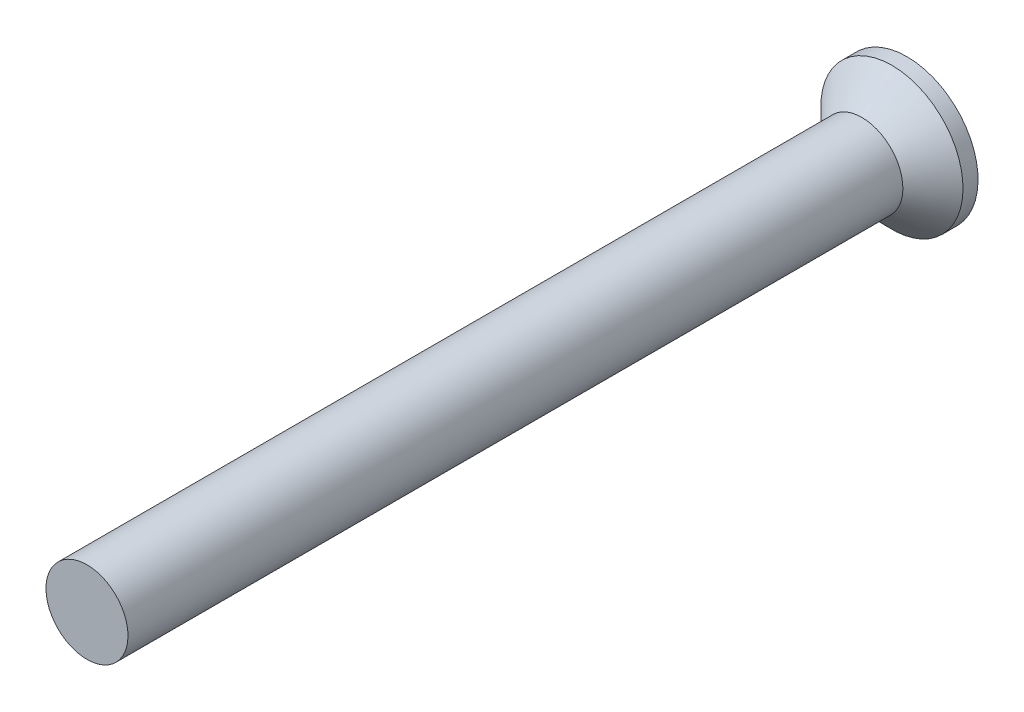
ISO-10303-21;
HEADER;
FILE_DESCRIPTION(('STEP AP214'),'2;1');
FILE_NAME('part.step','',(''),(''),'','','');
FILE_SCHEMA(('AUTOMOTIVE_DESIGN { 1 0 10303 214 1 1 1 1 }'));
ENDSEC;
DATA;
#1=APPLICATION_CONTEXT('core data for automotive mechanical design processes');
#2=APPLICATION_PROTOCOL_DEFINITION('international standard','automotive_design',2000,#1);
#3=PRODUCT_CONTEXT('',#1,'mechanical');
#4=PRODUCT('Part','Part','',(#3));
#5=PRODUCT_RELATED_PRODUCT_CATEGORY('part','',(#4));
#6=PRODUCT_DEFINITION_FORMATION('','',#4);
#7=PRODUCT_DEFINITION_CONTEXT('part definition',#1,'design');
#8=PRODUCT_DEFINITION('design','',#6,#7);
#9=PRODUCT_DEFINITION_SHAPE('','',#8);
#10=(LENGTH_UNIT() NAMED_UNIT(*) SI_UNIT(.MILLI.,.METRE.));
#11=(NAMED_UNIT(*) PLANE_ANGLE_UNIT() SI_UNIT($,.RADIAN.));
#12=(NAMED_UNIT(*) SI_UNIT($,.STERADIAN.) SOLID_ANGLE_UNIT());
#13=UNCERTAINTY_MEASURE_WITH_UNIT(LENGTH_MEASURE(1.E-05),#10,'distance_accuracy_value','');
#14=(GEOMETRIC_REPRESENTATION_CONTEXT(3) GLOBAL_UNCERTAINTY_ASSIGNED_CONTEXT((#13)) GLOBAL_UNIT_ASSIGNED_CONTEXT((#10,
#11,#12)) REPRESENTATION_CONTEXT('',''));
#15=CARTESIAN_POINT('',(0.,0.,0.));
#16=DIRECTION('',(0.,0.,1.));
#17=DIRECTION('',(1.,0.,0.));
#18=AXIS2_PLACEMENT_3D('',#15,#16,#17);
#19=CARTESIAN_POINT('',(-12.4477000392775,-12.8089585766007,-48.95));
#20=DIRECTION('',(0.466823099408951,0.815535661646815,0.34202014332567));
#21=DIRECTION('',(-0.867874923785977,0.496782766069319,0.));
#22=AXIS2_PLACEMENT_3D('',#19,#20,#21);
#23=PLANE('',#22);
#24=DIRECTION('',(0.334819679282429,0.19496847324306,-0.921891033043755));
#25=VECTOR('',#24,1.);
#26=CARTESIAN_POINT('',(-12.8609204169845,-13.0495804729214,-47.8122408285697));
#27=LINE('',#26,#25);
#28=CARTESIAN_POINT('',(-12.8609204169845,-13.0495804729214,-47.8122408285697));
#29=VERTEX_POINT('',#28);
#30=CARTESIAN_POINT('',(-12.7473300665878,-12.9834358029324,-48.125));
#31=VERTEX_POINT('',#30);
#32=EDGE_CURVE('E210',#29,#31,#27,.T.);
#33=ORIENTED_EDGE('',*,*,#32,.T.);
#34=DIRECTION('',(0.867874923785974,-0.496782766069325,0.));
#35=VECTOR('',#34,1.);
#36=CARTESIAN_POINT('',(-12.7473300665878,-12.9834358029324,-48.125));
#37=LINE('',#36,#35);
#38=CARTESIAN_POINT('',(-12.4356627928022,-13.1618381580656,-48.125));
#39=VERTEX_POINT('',#38);
#40=EDGE_CURVE('E429',#31,#39,#37,.T.);
#41=ORIENTED_EDGE('',*,*,#40,.T.);
#42=DIRECTION('',(-0.787968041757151,0.208004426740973,0.579517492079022));
#43=VECTOR('',#42,1.);
#44=CARTESIAN_POINT('',(-12.4356627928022,-13.1618381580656,-48.125));
#45=LINE('',#44,#43);
#46=EDGE_CURVE('E398',#39,#29,#45,.T.);
#47=ORIENTED_EDGE('',*,*,#46,.T.);
#48=EDGE_LOOP('',(#33,#41,#47));
#49=FACE_BOUND('',#48,.T.);
#50=ADVANCED_FACE('F17',(#49),#23,.F.);
#51=CARTESIAN_POINT('',(-12.6202985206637,-13.4628008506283,-48.95));
#52=DIRECTION('',(0.00348716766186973,-0.939686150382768,0.342020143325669));
#53=DIRECTION('',(0.,-0.34202222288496,-0.93969186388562));
#54=AXIS2_PLACEMENT_3D('',#51,#52,#53);
#55=PLANE('',#54);
#56=ORIENTED_EDGE('',*,*,#46,.F.);
#57=DIRECTION('',(-0.9999931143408,-0.0037109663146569,0.));
#58=VECTOR('',#57,1.);
#59=CARTESIAN_POINT('',(-12.4356627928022,-13.1618381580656,-48.125));
#60=LINE('',#59,#58);
#61=CARTESIAN_POINT('',(-12.7947757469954,-13.1631708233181,-48.125));
#62=VERTEX_POINT('',#61);
#63=EDGE_CURVE('E499',#39,#62,#60,.T.);
#64=ORIENTED_EDGE('',*,*,#63,.T.);
#65=DIRECTION('',(-0.19496847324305,0.33481967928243,0.921891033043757));
#66=VECTOR('',#65,1.);
#67=CARTESIAN_POINT('',(-12.7947757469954,-13.1631708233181,-48.125));
#68=LINE('',#67,#66);
#69=EDGE_CURVE('E395',#62,#29,#68,.T.);
#70=ORIENTED_EDGE('',*,*,#69,.T.);
#71=EDGE_LOOP('',(#56,#64,#70));
#72=FACE_BOUND('',#71,.T.);
#73=ADVANCED_FACE('F719',(#72),#55,.F.);
#74=CARTESIAN_POINT('',(-12.6202985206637,-13.4628008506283,-48.95));
#75=DIRECTION('',(0.815535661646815,-0.466823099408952,0.34202014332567));
#76=DIRECTION('',(0.49678276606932,0.867874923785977,0.));
#77=AXIS2_PLACEMENT_3D('',#74,#75,#76);
#78=PLANE('',#77);
#79=ORIENTED_EDGE('',*,*,#69,.F.);
#80=DIRECTION('',(-0.496782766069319,-0.867874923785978,0.));
#81=VECTOR('',#80,1.);
#82=CARTESIAN_POINT('',(-12.7947757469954,-13.1631708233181,-48.125));
#83=LINE('',#82,#81);
#84=CARTESIAN_POINT('',(-12.9731781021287,-13.4748380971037,-48.125));
#85=VERTEX_POINT('',#84);
#86=EDGE_CURVE('E497',#62,#85,#83,.T.);
#87=ORIENTED_EDGE('',*,*,#86,.T.);
#88=DIRECTION('',(0.208004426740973,0.787968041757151,0.579517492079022));
#89=VECTOR('',#88,1.);
#90=CARTESIAN_POINT('',(-12.9731781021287,-13.4748380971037,-48.125));
#91=LINE('',#90,#89);
#92=EDGE_CURVE('E392',#85,#29,#91,.T.);
#93=ORIENTED_EDGE('',*,*,#92,.T.);
#94=EDGE_LOOP('',(#79,#87,#93));
#95=FACE_BOUND('',#94,.T.);
#96=ADVANCED_FACE('F723',(#95),#78,.F.);
#97=CARTESIAN_POINT('',(-13.2741407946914,-13.2902023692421,-48.95));
#98=DIRECTION('',(-0.939686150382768,-0.00348716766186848,0.342020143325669));
#99=DIRECTION('',(0.34202222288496,0.,0.93969186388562));
#100=AXIS2_PLACEMENT_3D('',#97,#98,#99);
#101=PLANE('',#100);
#102=ORIENTED_EDGE('',*,*,#92,.F.);
#103=DIRECTION('',(-0.00371096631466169,0.9999931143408,0.));
#104=VECTOR('',#103,1.);
#105=CARTESIAN_POINT('',(-12.9731781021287,-13.4748380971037,-48.125));
#106=LINE('',#105,#104);
#107=CARTESIAN_POINT('',(-12.9745107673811,-13.1157251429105,-48.125));
#108=VERTEX_POINT('',#107);
#109=EDGE_CURVE('E495',#85,#108,#106,.T.);
#110=ORIENTED_EDGE('',*,*,#109,.T.);
#111=DIRECTION('',(0.334819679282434,0.19496847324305,0.921891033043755));
#112=VECTOR('',#111,1.);
#113=CARTESIAN_POINT('',(-12.9745107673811,-13.1157251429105,-48.125));
#114=LINE('',#113,#112);
#115=EDGE_CURVE('E389',#108,#29,#114,.T.);
#116=ORIENTED_EDGE('',*,*,#115,.T.);
#117=EDGE_LOOP('',(#102,#110,#116));
#118=FACE_BOUND('',#117,.T.);
#119=ADVANCED_FACE('F727',(#118),#101,.F.);
#120=CARTESIAN_POINT('',(-13.2741407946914,-13.2902023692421,-48.95));
#121=DIRECTION('',(-0.46682309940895,-0.815535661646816,0.342020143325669));
#122=DIRECTION('',(0.867874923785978,-0.496782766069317,0.));
#123=AXIS2_PLACEMENT_3D('',#120,#121,#122);
#124=PLANE('',#123);
#125=ORIENTED_EDGE('',*,*,#115,.F.);
#126=DIRECTION('',(-0.867874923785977,0.496782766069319,0.));
#127=VECTOR('',#126,1.);
#128=CARTESIAN_POINT('',(-12.9745107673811,-13.1157251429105,-48.125));
#129=LINE('',#128,#127);
#130=CARTESIAN_POINT('',(-13.2861780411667,-12.9373227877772,-48.125));
#131=VERTEX_POINT('',#130);
#132=EDGE_CURVE('E493',#108,#131,#129,.T.);
#133=ORIENTED_EDGE('',*,*,#132,.T.);
#134=DIRECTION('',(0.787968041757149,-0.208004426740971,0.579517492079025));
#135=VECTOR('',#134,1.);
#136=CARTESIAN_POINT('',(-13.2861780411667,-12.9373227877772,-48.125));
#137=LINE('',#136,#135);
#138=EDGE_CURVE('E386',#131,#29,#137,.T.);
#139=ORIENTED_EDGE('',*,*,#138,.T.);
#140=EDGE_LOOP('',(#125,#133,#139));
#141=FACE_BOUND('',#140,.T.);
#142=ADVANCED_FACE('F730',(#141),#124,.F.);
#143=CARTESIAN_POINT('',(-13.1015423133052,-12.6363600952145,-48.95));
#144=DIRECTION('',(-0.00348716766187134,0.939686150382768,0.34202014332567));
#145=DIRECTION('',(0.,-0.34202222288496,0.93969186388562));
#146=AXIS2_PLACEMENT_3D('',#143,#144,#145);
#147=PLANE('',#146);
#148=ORIENTED_EDGE('',*,*,#138,.F.);
#149=DIRECTION('',(0.9999931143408,0.00371096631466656,0.));
#150=VECTOR('',#149,1.);
#151=CARTESIAN_POINT('',(-13.2861780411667,-12.9373227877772,-48.125));
#152=LINE('',#151,#150);
#153=CARTESIAN_POINT('',(-12.9270650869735,-12.9359901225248,-48.125));
#154=VERTEX_POINT('',#153);
#155=EDGE_CURVE('E491',#131,#154,#152,.T.);
#156=ORIENTED_EDGE('',*,*,#155,.T.);
#157=DIRECTION('',(0.19496847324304,-0.334819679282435,0.921891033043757));
#158=VECTOR('',#157,1.);
#159=CARTESIAN_POINT('',(-12.9270650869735,-12.9359901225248,-48.125));
#160=LINE('',#159,#158);
#161=EDGE_CURVE('E383',#154,#29,#160,.T.);
#162=ORIENTED_EDGE('',*,*,#161,.T.);
#163=EDGE_LOOP('',(#148,#156,#162));
#164=FACE_BOUND('',#163,.T.);
#165=ADVANCED_FACE('F732',(#164),#147,.F.);
#166=CARTESIAN_POINT('',(-13.1015423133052,-12.6363600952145,-48.95));
#167=DIRECTION('',(-0.815535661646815,0.466823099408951,0.342020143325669));
#168=DIRECTION('',(-0.496782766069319,-0.867874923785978,0.));
#169=AXIS2_PLACEMENT_3D('',#166,#167,#168);
#170=PLANE('',#169);
#171=ORIENTED_EDGE('',*,*,#161,.F.);
#172=DIRECTION('',(0.496782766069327,0.867874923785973,0.));
#173=VECTOR('',#172,1.);
#174=CARTESIAN_POINT('',(-12.9270650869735,-12.9359901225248,-48.125));
#175=LINE('',#174,#173);
#176=CARTESIAN_POINT('',(-12.7486627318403,-12.6243228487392,-48.125));
#177=VERTEX_POINT('',#176);
#178=EDGE_CURVE('E489',#154,#177,#175,.T.);
#179=ORIENTED_EDGE('',*,*,#178,.T.);
#180=DIRECTION('',(-0.208004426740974,-0.787968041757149,0.579517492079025));
#181=VECTOR('',#180,1.);
#182=CARTESIAN_POINT('',(-12.7486627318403,-12.6243228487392,-48.125));
#183=LINE('',#182,#181);
#184=EDGE_CURVE('E380',#177,#29,#183,.T.);
#185=ORIENTED_EDGE('',*,*,#184,.T.);
#186=EDGE_LOOP('',(#171,#179,#185));
#187=FACE_BOUND('',#186,.T.);
#188=ADVANCED_FACE('F711',(#187),#170,.F.);
#189=CARTESIAN_POINT('',(-12.4477000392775,-12.8089585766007,-48.95));
#190=DIRECTION('',(0.939686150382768,0.00348716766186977,0.342020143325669));
#191=DIRECTION('',(0.34202222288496,0.,-0.93969186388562));
#192=AXIS2_PLACEMENT_3D('',#189,#190,#191);
#193=PLANE('',#192);
#194=ORIENTED_EDGE('',*,*,#184,.F.);
#195=DIRECTION('',(0.00371096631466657,-0.9999931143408,0.));
#196=VECTOR('',#195,1.);
#197=CARTESIAN_POINT('',(-12.7486627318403,-12.6243228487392,-48.125));
#198=LINE('',#197,#196);
#199=EDGE_CURVE('E427',#177,#31,#198,.T.);
#200=ORIENTED_EDGE('',*,*,#199,.T.);
#201=ORIENTED_EDGE('',*,*,#32,.F.);
#202=EDGE_LOOP('',(#194,#200,#201));
#203=FACE_BOUND('',#202,.T.);
#204=ADVANCED_FACE('F623',(#203),#193,.F.);
#205=CARTESIAN_POINT('',(-12.6371291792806,-12.2018084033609,-48.125));
#206=DIRECTION('',(0.,0.,1.));
#207=DIRECTION('',(0.,-1.,0.));
#208=AXIS2_PLACEMENT_3D('',#205,#206,#207);
#209=CYLINDRICAL_SURFACE('',#208,0.3);
#210=CARTESIAN_POINT('',(-12.6371291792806,-12.2018084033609,-48.4357416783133));
#211=DIRECTION('',(0.939686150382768,0.00348716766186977,0.342020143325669));
#212=DIRECTION('',(-0.342017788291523,-0.0012692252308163,0.939692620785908));
#213=AXIS2_PLACEMENT_3D('',#210,#211,#212);
#214=ELLIPSE('',#213,0.877141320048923,0.3);
#215=CARTESIAN_POINT('',(-12.7136990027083,-12.4918722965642,-48.2224118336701));
#216=VERTEX_POINT('',#215);
#217=CARTESIAN_POINT('',(-12.4861660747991,-12.4610575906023,-48.8478632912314));
#218=VERTEX_POINT('',#217);
#219=EDGE_CURVE('E342',#216,#218,#214,.T.);
#220=ORIENTED_EDGE('',*,*,#219,.T.);
#221=DIRECTION('',(0.,0.,1.));
#222=VECTOR('',#221,1.);
#223=CARTESIAN_POINT('',(-12.4861660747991,-12.4610575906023,-48.125));
#224=LINE('',#223,#222);
#225=CARTESIAN_POINT('',(-12.4861660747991,-12.4610575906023,-48.125));
#226=VERTEX_POINT('',#225);
#227=EDGE_CURVE('E339',#226,#218,#224,.F.);
#228=ORIENTED_EDGE('',*,*,#227,.F.);
#229=CARTESIAN_POINT('',(-12.6371291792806,-12.2018084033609,-48.125));
#230=DIRECTION('',(0.,0.,1.));
#231=DIRECTION('',(0.,-1.,0.));
#232=AXIS2_PLACEMENT_3D('',#229,#230,#231);
#233=CIRCLE('',#232,0.3);
#234=CARTESIAN_POINT('',(-12.896378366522,-12.3527715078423,-48.125));
#235=VERTEX_POINT('',#234);
#236=EDGE_CURVE('E209',#226,#235,#233,.F.);
#237=ORIENTED_EDGE('',*,*,#236,.T.);
#238=DIRECTION('',(0.,0.,1.));
#239=VECTOR('',#238,1.);
#240=CARTESIAN_POINT('',(-12.896378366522,-12.3527715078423,-48.125));
#241=LINE('',#240,#239);
#242=CARTESIAN_POINT('',(-12.896378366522,-12.3527715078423,-48.8478632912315));
#243=VERTEX_POINT('',#242);
#244=EDGE_CURVE('E299',#243,#235,#241,.T.);
#245=ORIENTED_EDGE('',*,*,#244,.F.);
#246=CARTESIAN_POINT('',(-12.6371291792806,-12.2018084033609,-48.4357416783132));
#247=DIRECTION('',(-0.815535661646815,0.466823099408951,0.342020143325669));
#248=DIRECTION('',(0.296830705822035,-0.169909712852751,0.939692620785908));
#249=AXIS2_PLACEMENT_3D('',#246,#247,#248);
#250=ELLIPSE('',#249,0.877141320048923,0.3);
#251=EDGE_CURVE('E421',#243,#216,#250,.T.);
#252=ORIENTED_EDGE('',*,*,#251,.T.);
#253=EDGE_LOOP('',(#220,#228,#237,#245,#252));
#254=FACE_BOUND('',#253,.T.);
#255=ADVANCED_FACE('F434',(#254),#209,.T.);
#256=CARTESIAN_POINT('',(-13.708692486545,-12.8257892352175,-48.125));
#257=DIRECTION('',(0.,0.,1.));
#258=DIRECTION('',(0.,-1.,0.));
#259=AXIS2_PLACEMENT_3D('',#256,#257,#258);
#260=CYLINDRICAL_SURFACE('',#259,0.3);
#261=CARTESIAN_POINT('',(-13.708692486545,-12.8257892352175,-48.4357416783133));
#262=DIRECTION('',(-0.00348716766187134,0.939686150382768,0.34202014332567));
#263=DIRECTION('',(0.00126922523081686,-0.342017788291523,0.939692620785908));
#264=AXIS2_PLACEMENT_3D('',#261,#262,#263);
#265=ELLIPSE('',#264,0.877141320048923,0.3);
#266=CARTESIAN_POINT('',(-13.4186285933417,-12.9023590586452,-48.2224118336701));
#267=VERTEX_POINT('',#266);
#268=CARTESIAN_POINT('',(-13.4494432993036,-12.6748261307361,-48.8478632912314));
#269=VERTEX_POINT('',#268);
#270=EDGE_CURVE('E280',#267,#269,#265,.T.);
#271=ORIENTED_EDGE('',*,*,#270,.T.);
#272=DIRECTION('',(0.,0.,1.));
#273=VECTOR('',#272,1.);
#274=CARTESIAN_POINT('',(-13.4494432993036,-12.6748261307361,-48.125));
#275=LINE('',#274,#273);
#276=CARTESIAN_POINT('',(-13.4494432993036,-12.6748261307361,-48.125));
#277=VERTEX_POINT('',#276);
#278=EDGE_CURVE('E277',#277,#269,#275,.F.);
#279=ORIENTED_EDGE('',*,*,#278,.F.);
#280=CARTESIAN_POINT('',(-13.708692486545,-12.8257892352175,-48.125));
#281=DIRECTION('',(0.,0.,1.));
#282=DIRECTION('',(0.,-1.,0.));
#283=AXIS2_PLACEMENT_3D('',#280,#281,#282);
#284=CIRCLE('',#283,0.3);
#285=CARTESIAN_POINT('',(-13.5577293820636,-13.0850384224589,-48.125));
#286=VERTEX_POINT('',#285);
#287=EDGE_CURVE('E428',#277,#286,#284,.F.);
#288=ORIENTED_EDGE('',*,*,#287,.T.);
#289=DIRECTION('',(0.,0.,1.));
#290=VECTOR('',#289,1.);
#291=CARTESIAN_POINT('',(-13.5577293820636,-13.0850384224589,-48.125));
#292=LINE('',#291,#290);
#293=CARTESIAN_POINT('',(-13.5577293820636,-13.0850384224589,-48.8478632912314));
#294=VERTEX_POINT('',#293);
#295=EDGE_CURVE('E235',#294,#286,#292,.T.);
#296=ORIENTED_EDGE('',*,*,#295,.F.);
#297=CARTESIAN_POINT('',(-13.708692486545,-12.8257892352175,-48.4357416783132));
#298=DIRECTION('',(-0.46682309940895,-0.815535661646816,0.342020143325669));
#299=DIRECTION('',(0.16990971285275,0.296830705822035,0.939692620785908));
#300=AXIS2_PLACEMENT_3D('',#297,#298,#299);
#301=ELLIPSE('',#300,0.877141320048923,0.3);
#302=EDGE_CURVE('E417',#294,#267,#301,.T.);
#303=ORIENTED_EDGE('',*,*,#302,.T.);
#304=EDGE_LOOP('',(#271,#279,#288,#296,#303));
#305=FACE_BOUND('',#304,.T.);
#306=ADVANCED_FACE('F614',(#305),#260,.T.);
#307=CARTESIAN_POINT('',(-13.0847116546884,-13.897352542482,-48.125));
#308=DIRECTION('',(0.,0.,1.));
#309=DIRECTION('',(0.,-1.,0.));
#310=AXIS2_PLACEMENT_3D('',#307,#308,#309);
#311=CYLINDRICAL_SURFACE('',#310,0.3);
#312=CARTESIAN_POINT('',(-13.0847116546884,-13.897352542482,-48.4357416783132));
#313=DIRECTION('',(-0.939686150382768,-0.00348716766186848,0.342020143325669));
#314=DIRECTION('',(0.342017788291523,0.00126922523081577,0.939692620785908));
#315=AXIS2_PLACEMENT_3D('',#312,#313,#314);
#316=ELLIPSE('',#315,0.877141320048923,0.3);
#317=CARTESIAN_POINT('',(-13.0081418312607,-13.6072886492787,-48.2224118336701));
#318=VERTEX_POINT('',#317);
#319=CARTESIAN_POINT('',(-13.2356747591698,-13.6381033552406,-48.8478632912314));
#320=VERTEX_POINT('',#319);
#321=EDGE_CURVE('E215',#318,#320,#316,.T.);
#322=ORIENTED_EDGE('',*,*,#321,.T.);
#323=DIRECTION('',(0.,0.,1.));
#324=VECTOR('',#323,1.);
#325=CARTESIAN_POINT('',(-13.2356747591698,-13.6381033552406,-48.125));
#326=LINE('',#325,#324);
#327=CARTESIAN_POINT('',(-13.2356747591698,-13.6381033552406,-48.125));
#328=VERTEX_POINT('',#327);
#329=EDGE_CURVE('E212',#328,#320,#326,.F.);
#330=ORIENTED_EDGE('',*,*,#329,.F.);
#331=CARTESIAN_POINT('',(-13.0847116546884,-13.897352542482,-48.125));
#332=DIRECTION('',(0.,0.,1.));
#333=DIRECTION('',(0.,-1.,0.));
#334=AXIS2_PLACEMENT_3D('',#331,#332,#333);
#335=CIRCLE('',#334,0.3);
#336=CARTESIAN_POINT('',(-12.825462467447,-13.7463894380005,-48.125));
#337=VERTEX_POINT('',#336);
#338=EDGE_CURVE('E20',#328,#337,#335,.F.);
#339=ORIENTED_EDGE('',*,*,#338,.T.);
#340=DIRECTION('',(0.,0.,1.));
#341=VECTOR('',#340,1.);
#342=CARTESIAN_POINT('',(-12.825462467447,-13.7463894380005,-48.125));
#343=LINE('',#342,#341);
#344=CARTESIAN_POINT('',(-12.825462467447,-13.7463894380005,-48.8478632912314));
#345=VERTEX_POINT('',#344);
#346=EDGE_CURVE('E509',#345,#337,#343,.T.);
#347=ORIENTED_EDGE('',*,*,#346,.F.);
#348=CARTESIAN_POINT('',(-13.0847116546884,-13.897352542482,-48.4357416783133));
#349=DIRECTION('',(0.815535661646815,-0.466823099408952,0.34202014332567));
#350=DIRECTION('',(-0.296830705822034,0.169909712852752,0.939692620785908));
#351=AXIS2_PLACEMENT_3D('',#348,#349,#350);
#352=ELLIPSE('',#351,0.877141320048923,0.3);
#353=EDGE_CURVE('E412',#345,#318,#352,.T.);
#354=ORIENTED_EDGE('',*,*,#353,.T.);
#355=EDGE_LOOP('',(#322,#330,#339,#347,#354));
#356=FACE_BOUND('',#355,.T.);
#357=ADVANCED_FACE('F213',(#356),#311,.T.);
#358=CARTESIAN_POINT('',(-13.2984801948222,-12.9340753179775,-48.125));
#359=DIRECTION('',(0.,0.,1.));
#360=DIRECTION('',(0.,-1.,0.));
#361=AXIS2_PLACEMENT_3D('',#358,#359,#360);
#362=PLANE('',#361);
#363=ORIENTED_EDGE('',*,*,#178,.F.);
#364=ORIENTED_EDGE('',*,*,#155,.F.);
#365=ORIENTED_EDGE('',*,*,#132,.F.);
#366=ORIENTED_EDGE('',*,*,#109,.F.);
#367=ORIENTED_EDGE('',*,*,#86,.F.);
#368=ORIENTED_EDGE('',*,*,#63,.F.);
#369=ORIENTED_EDGE('',*,*,#40,.F.);
#370=ORIENTED_EDGE('',*,*,#199,.F.);
#371=EDGE_LOOP('',(#363,#364,#365,#366,#367,#368,#369,#370));
#372=FACE_BOUND('',#371,.T.);
#373=DIRECTION('',(-0.503210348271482,0.86416395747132,0.));
#374=VECTOR('',#373,1.);
#375=CARTESIAN_POINT('',(-13.2984801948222,-12.9340753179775,-48.125));
#376=LINE('',#375,#374);
#377=CARTESIAN_POINT('',(-13.702903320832,-12.239558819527,-48.125));
#378=VERTEX_POINT('',#377);
#379=EDGE_CURVE('E281',#378,#277,#376,.F.);
#380=ORIENTED_EDGE('',*,*,#379,.F.);
#381=DIRECTION('',(-0.86416395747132,-0.503210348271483,0.));
#382=VECTOR('',#381,1.);
#383=CARTESIAN_POINT('',(-13.1498383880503,-11.9175041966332,-48.125));
#384=LINE('',#383,#382);
#385=CARTESIAN_POINT('',(-13.1498383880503,-11.9175041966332,-48.125));
#386=VERTEX_POINT('',#385);
#387=EDGE_CURVE('E297',#386,#378,#384,.T.);
#388=ORIENTED_EDGE('',*,*,#387,.F.);
#389=DIRECTION('',(0.503210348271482,-0.86416395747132,0.));
#390=VECTOR('',#389,1.);
#391=CARTESIAN_POINT('',(-12.7454152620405,-12.6120206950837,-48.125));
#392=LINE('',#391,#390);
#393=EDGE_CURVE('E307',#235,#386,#392,.F.);
#394=ORIENTED_EDGE('',*,*,#393,.F.);
#395=ORIENTED_EDGE('',*,*,#236,.F.);
#396=DIRECTION('',(0.86416395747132,0.503210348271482,0.));
#397=VECTOR('',#396,1.);
#398=CARTESIAN_POINT('',(-12.7454152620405,-12.6120206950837,-48.125));
#399=LINE('',#398,#397);
#400=CARTESIAN_POINT('',(-12.05089876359,-12.2075975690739,-48.125));
#401=VERTEX_POINT('',#400);
#402=EDGE_CURVE('E343',#401,#226,#399,.F.);
#403=ORIENTED_EDGE('',*,*,#402,.F.);
#404=DIRECTION('',(-0.503210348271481,0.864163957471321,0.));
#405=VECTOR('',#404,1.);
#406=CARTESIAN_POINT('',(-11.7288441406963,-12.7606625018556,-48.125));
#407=LINE('',#406,#405);
#408=CARTESIAN_POINT('',(-11.7288441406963,-12.7606625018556,-48.125));
#409=VERTEX_POINT('',#408);
#410=EDGE_CURVE('E359',#409,#401,#407,.T.);
#411=ORIENTED_EDGE('',*,*,#410,.F.);
#412=DIRECTION('',(-0.86416395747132,-0.503210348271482,0.));
#413=VECTOR('',#412,1.);
#414=CARTESIAN_POINT('',(-12.4233606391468,-13.1650856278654,-48.125));
#415=LINE('',#414,#413);
#416=CARTESIAN_POINT('',(-12.1641114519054,-13.0141225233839,-48.125));
#417=VERTEX_POINT('',#416);
#418=EDGE_CURVE('E369',#417,#409,#415,.F.);
#419=ORIENTED_EDGE('',*,*,#418,.F.);
#420=CARTESIAN_POINT('',(-12.0131483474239,-13.2733717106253,-48.125));
#421=DIRECTION('',(0.,0.,1.));
#422=DIRECTION('',(0.,-1.,0.));
#423=AXIS2_PLACEMENT_3D('',#420,#421,#422);
#424=CIRCLE('',#423,0.3);
#425=CARTESIAN_POINT('',(-12.2723975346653,-13.4243348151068,-48.125));
#426=VERTEX_POINT('',#425);
#427=EDGE_CURVE('E372',#426,#417,#424,.F.);
#428=ORIENTED_EDGE('',*,*,#427,.F.);
#429=DIRECTION('',(0.503210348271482,-0.86416395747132,0.));
#430=VECTOR('',#429,1.);
#431=CARTESIAN_POINT('',(-12.4233606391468,-13.1650856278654,-48.125));
#432=LINE('',#431,#430);
#433=CARTESIAN_POINT('',(-12.0189375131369,-13.8596021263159,-48.125));
#434=VERTEX_POINT('',#433);
#435=EDGE_CURVE('E476',#434,#426,#432,.F.);
#436=ORIENTED_EDGE('',*,*,#435,.F.);
#437=DIRECTION('',(0.86416395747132,0.503210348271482,0.));
#438=VECTOR('',#437,1.);
#439=CARTESIAN_POINT('',(-12.5720024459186,-14.1816567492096,-48.125));
#440=LINE('',#439,#438);
#441=CARTESIAN_POINT('',(-12.5720024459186,-14.1816567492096,-48.125));
#442=VERTEX_POINT('',#441);
#443=EDGE_CURVE('E507',#442,#434,#440,.T.);
#444=ORIENTED_EDGE('',*,*,#443,.F.);
#445=DIRECTION('',(-0.503210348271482,0.86416395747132,0.));
#446=VECTOR('',#445,1.);
#447=CARTESIAN_POINT('',(-12.9764255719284,-13.4871402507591,-48.125));
#448=LINE('',#447,#446);
#449=EDGE_CURVE('E205',#337,#442,#448,.F.);
#450=ORIENTED_EDGE('',*,*,#449,.F.);
#451=ORIENTED_EDGE('',*,*,#338,.F.);
#452=DIRECTION('',(-0.86416395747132,-0.503210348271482,0.));
#453=VECTOR('',#452,1.);
#454=CARTESIAN_POINT('',(-12.9764255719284,-13.4871402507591,-48.125));
#455=LINE('',#454,#453);
#456=CARTESIAN_POINT('',(-13.6709420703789,-13.8915633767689,-48.125));
#457=VERTEX_POINT('',#456);
#458=EDGE_CURVE('E202',#457,#328,#455,.F.);
#459=ORIENTED_EDGE('',*,*,#458,.F.);
#460=DIRECTION('',(0.503210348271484,-0.864163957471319,0.));
#461=VECTOR('',#460,1.);
#462=CARTESIAN_POINT('',(-13.9929966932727,-13.3384984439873,-48.125));
#463=LINE('',#462,#461);
#464=CARTESIAN_POINT('',(-13.9929966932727,-13.3384984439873,-48.125));
#465=VERTEX_POINT('',#464);
#466=EDGE_CURVE('E233',#465,#457,#463,.T.);
#467=ORIENTED_EDGE('',*,*,#466,.F.);
#468=DIRECTION('',(0.86416395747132,0.503210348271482,0.));
#469=VECTOR('',#468,1.);
#470=CARTESIAN_POINT('',(-13.2984801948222,-12.9340753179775,-48.125));
#471=LINE('',#470,#469);
#472=EDGE_CURVE('E245',#286,#465,#471,.F.);
#473=ORIENTED_EDGE('',*,*,#472,.F.);
#474=ORIENTED_EDGE('',*,*,#287,.F.);
#475=EDGE_LOOP('',(#380,#388,#394,#395,#403,#411,#419,#428,#436,#444,#450,#451,#459,#467,#473,#474));
#476=FACE_BOUND('',#475,.T.);
#477=ADVANCED_FACE('F200',(#372,#476),#362,.F.);
#478=CARTESIAN_POINT('',(-12.0131483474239,-13.2733717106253,-48.125));
#479=DIRECTION('',(0.,0.,1.));
#480=DIRECTION('',(0.,-1.,0.));
#481=AXIS2_PLACEMENT_3D('',#478,#479,#480);
#482=CYLINDRICAL_SURFACE('',#481,0.3);
#483=CARTESIAN_POINT('',(-12.0131483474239,-13.2733717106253,-48.4357416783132));
#484=DIRECTION('',(0.466823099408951,0.815535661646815,0.34202014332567));
#485=DIRECTION('',(-0.169909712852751,-0.296830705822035,0.939692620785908));
#486=AXIS2_PLACEMENT_3D('',#483,#484,#485);
#487=ELLIPSE('',#486,0.877141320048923,0.3);
#488=CARTESIAN_POINT('',(-12.1641114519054,-13.0141225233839,-48.8478632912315));
#489=VERTEX_POINT('',#488);
#490=CARTESIAN_POINT('',(-12.3032122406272,-13.1968018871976,-48.2224118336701));
#491=VERTEX_POINT('',#490);
#492=EDGE_CURVE('E405',#489,#491,#487,.T.);
#493=ORIENTED_EDGE('',*,*,#492,.T.);
#494=CARTESIAN_POINT('',(-12.0131483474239,-13.2733717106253,-48.4357416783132));
#495=DIRECTION('',(0.00348716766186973,-0.939686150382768,0.342020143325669));
#496=DIRECTION('',(-0.00126922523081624,0.342017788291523,0.939692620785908));
#497=AXIS2_PLACEMENT_3D('',#494,#495,#496);
#498=ELLIPSE('',#497,0.877141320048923,0.3);
#499=CARTESIAN_POINT('',(-12.2723975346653,-13.4243348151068,-48.8478632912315));
#500=VERTEX_POINT('',#499);
#501=EDGE_CURVE('E408',#491,#500,#498,.T.);
#502=ORIENTED_EDGE('',*,*,#501,.T.);
#503=DIRECTION('',(0.,0.,1.));
#504=VECTOR('',#503,1.);
#505=CARTESIAN_POINT('',(-12.2723975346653,-13.4243348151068,-48.125));
#506=LINE('',#505,#504);
#507=EDGE_CURVE('E411',#426,#500,#506,.F.);
#508=ORIENTED_EDGE('',*,*,#507,.F.);
#509=ORIENTED_EDGE('',*,*,#427,.T.);
#510=DIRECTION('',(0.,0.,1.));
#511=VECTOR('',#510,1.);
#512=CARTESIAN_POINT('',(-12.1641114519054,-13.0141225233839,-48.125));
#513=LINE('',#512,#511);
#514=EDGE_CURVE('E361',#489,#417,#513,.T.);
#515=ORIENTED_EDGE('',*,*,#514,.F.);
#516=EDGE_LOOP('',(#493,#502,#508,#509,#515));
#517=FACE_BOUND('',#516,.T.);
#518=ADVANCED_FACE('F694',(#517),#482,.T.);
#519=CARTESIAN_POINT('',(-12.4233606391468,-13.1650856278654,-48.125));
#520=DIRECTION('',(-0.503210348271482,0.86416395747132,0.));
#521=DIRECTION('',(-0.86416395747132,-0.503210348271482,0.));
#522=AXIS2_PLACEMENT_3D('',#519,#520,#521);
#523=PLANE('',#522);
#524=DIRECTION('',(-0.334819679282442,-0.194968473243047,0.921891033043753));
#525=VECTOR('',#524,1.);
#526=CARTESIAN_POINT('',(-12.1270166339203,-12.9925218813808,-48.95));
#527=LINE('',#526,#525);
#528=CARTESIAN_POINT('',(-12.1270166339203,-12.9925218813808,-48.95));
#529=VERTEX_POINT('',#528);
#530=EDGE_CURVE('E407',#529,#489,#527,.T.);
#531=ORIENTED_EDGE('',*,*,#530,.T.);
#532=ORIENTED_EDGE('',*,*,#514,.T.);
#533=ORIENTED_EDGE('',*,*,#418,.T.);
#534=DIRECTION('',(-0.432081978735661,-0.251605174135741,0.866025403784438));
#535=VECTOR('',#534,1.);
#536=CARTESIAN_POINT('',(-11.3172307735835,-12.5209763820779,-48.95));
#537=LINE('',#536,#535);
#538=CARTESIAN_POINT('',(-11.3172307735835,-12.5209763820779,-48.95));
#539=VERTEX_POINT('',#538);
#540=EDGE_CURVE('E356',#539,#409,#537,.T.);
#541=ORIENTED_EDGE('',*,*,#540,.F.);
#542=DIRECTION('',(0.86416395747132,0.503210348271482,0.));
#543=VECTOR('',#542,1.);
#544=CARTESIAN_POINT('',(-12.1270166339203,-12.9925218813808,-48.95));
#545=LINE('',#544,#543);
#546=EDGE_CURVE('E366',#529,#539,#545,.T.);
#547=ORIENTED_EDGE('',*,*,#546,.F.);
#548=EDGE_LOOP('',(#531,#532,#533,#541,#547));
#549=FACE_BOUND('',#548,.T.);
#550=ADVANCED_FACE('F690',(#549),#523,.T.);
#551=CARTESIAN_POINT('',(-11.6392853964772,-11.9679114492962,-48.95));
#552=DIRECTION('',(-0.748387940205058,-0.435792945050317,-0.500000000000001));
#553=DIRECTION('',(-0.555526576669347,0.,0.831498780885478));
#554=AXIS2_PLACEMENT_3D('',#551,#552,#553);
#555=PLANE('',#554);
#556=DIRECTION('',(-0.503210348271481,0.864163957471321,0.));
#557=VECTOR('',#556,1.);
#558=CARTESIAN_POINT('',(-11.3172307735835,-12.5209763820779,-48.95));
#559=LINE('',#558,#557);
#560=CARTESIAN_POINT('',(-11.6392853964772,-11.9679114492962,-48.95));
#561=VERTEX_POINT('',#560);
#562=EDGE_CURVE('E346',#539,#561,#559,.T.);
#563=ORIENTED_EDGE('',*,*,#562,.F.);
#564=ORIENTED_EDGE('',*,*,#540,.T.);
#565=ORIENTED_EDGE('',*,*,#410,.T.);
#566=DIRECTION('',(-0.432081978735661,-0.251605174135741,0.866025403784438));
#567=VECTOR('',#566,1.);
#568=CARTESIAN_POINT('',(-11.6392853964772,-11.9679114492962,-48.95));
#569=LINE('',#568,#567);
#570=EDGE_CURVE('E351',#561,#401,#569,.T.);
#571=ORIENTED_EDGE('',*,*,#570,.F.);
#572=EDGE_LOOP('',(#563,#564,#565,#571));
#573=FACE_BOUND('',#572,.T.);
#574=ADVANCED_FACE('F687',(#573),#555,.T.);
#575=CARTESIAN_POINT('',(-12.7454152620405,-12.6120206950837,-48.125));
#576=DIRECTION('',(0.503210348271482,-0.86416395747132,0.));
#577=DIRECTION('',(0.86416395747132,0.503210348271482,0.));
#578=AXIS2_PLACEMENT_3D('',#575,#576,#577);
#579=PLANE('',#578);
#580=DIRECTION('',(0.334819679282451,0.194968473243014,-0.921891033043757));
#581=VECTOR('',#580,1.);
#582=CARTESIAN_POINT('',(-12.4861660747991,-12.4610575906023,-48.8478632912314));
#583=LINE('',#582,#581);
#584=CARTESIAN_POINT('',(-12.449071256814,-12.4394569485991,-48.95));
#585=VERTEX_POINT('',#584);
#586=EDGE_CURVE('E423',#218,#585,#583,.T.);
#587=ORIENTED_EDGE('',*,*,#586,.T.);
#588=DIRECTION('',(-0.864163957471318,-0.503210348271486,0.));
#589=VECTOR('',#588,1.);
#590=CARTESIAN_POINT('',(-11.6392853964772,-11.9679114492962,-48.95));
#591=LINE('',#590,#589);
#592=EDGE_CURVE('E336',#561,#585,#591,.T.);
#593=ORIENTED_EDGE('',*,*,#592,.F.);
#594=ORIENTED_EDGE('',*,*,#570,.T.);
#595=ORIENTED_EDGE('',*,*,#402,.T.);
#596=ORIENTED_EDGE('',*,*,#227,.T.);
#597=EDGE_LOOP('',(#587,#593,#594,#595,#596));
#598=FACE_BOUND('',#597,.T.);
#599=ADVANCED_FACE('F684',(#598),#579,.T.);
#600=CARTESIAN_POINT('',(-12.4477000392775,-12.8089585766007,-48.95));
#601=DIRECTION('',(0.939686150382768,0.00348716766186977,0.342020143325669));
#602=DIRECTION('',(0.34202222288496,0.,-0.93969186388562));
#603=AXIS2_PLACEMENT_3D('',#600,#601,#602);
#604=PLANE('',#603);
#605=DIRECTION('',(-0.00371096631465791,0.9999931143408,0.));
#606=VECTOR('',#605,1.);
#607=CARTESIAN_POINT('',(-12.449071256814,-12.4394569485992,-48.95));
#608=LINE('',#607,#606);
#609=CARTESIAN_POINT('',(-12.4525480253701,-11.5025730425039,-48.95));
#610=VERTEX_POINT('',#609);
#611=EDGE_CURVE('E331',#585,#610,#608,.T.);
#612=ORIENTED_EDGE('',*,*,#611,.F.);
#613=ORIENTED_EDGE('',*,*,#586,.F.);
#614=ORIENTED_EDGE('',*,*,#219,.F.);
#615=DIRECTION('',(0.208004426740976,0.787968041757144,-0.579517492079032));
#616=VECTOR('',#615,1.);
#617=CARTESIAN_POINT('',(-12.7136990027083,-12.4918722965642,-48.2224118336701));
#618=LINE('',#617,#616);
#619=EDGE_CURVE('E311',#216,#610,#618,.T.);
#620=ORIENTED_EDGE('',*,*,#619,.T.);
#621=EDGE_LOOP('',(#612,#613,#614,#620));
#622=FACE_BOUND('',#621,.T.);
#623=ADVANCED_FACE('F448',(#622),#604,.F.);
#624=CARTESIAN_POINT('',(-13.1015423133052,-12.6363600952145,-48.95));
#625=DIRECTION('',(-0.815535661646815,0.466823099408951,0.342020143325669));
#626=DIRECTION('',(-0.496782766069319,-0.867874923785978,0.));
#627=AXIS2_PLACEMENT_3D('',#624,#625,#626);
#628=PLANE('',#627);
#629=ORIENTED_EDGE('',*,*,#251,.F.);
#630=DIRECTION('',(0.194968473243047,-0.334819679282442,0.921891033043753));
#631=VECTOR('',#630,1.);
#632=CARTESIAN_POINT('',(-12.9179790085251,-12.3156766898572,-48.95));
#633=LINE('',#632,#631);
#634=CARTESIAN_POINT('',(-12.9179790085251,-12.3156766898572,-48.95));
#635=VERTEX_POINT('',#634);
#636=EDGE_CURVE('E310',#635,#243,#633,.T.);
#637=ORIENTED_EDGE('',*,*,#636,.F.);
#638=DIRECTION('',(-0.49678276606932,-0.867874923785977,0.));
#639=VECTOR('',#638,1.);
#640=CARTESIAN_POINT('',(-12.4525480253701,-11.5025730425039,-48.95));
#641=LINE('',#640,#639);
#642=EDGE_CURVE('E326',#610,#635,#641,.T.);
#643=ORIENTED_EDGE('',*,*,#642,.F.);
#644=ORIENTED_EDGE('',*,*,#619,.F.);
#645=EDGE_LOOP('',(#629,#637,#643,#644));
#646=FACE_BOUND('',#645,.T.);
#647=ADVANCED_FACE('F442',(#646),#628,.F.);
#648=CARTESIAN_POINT('',(-12.7454152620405,-12.6120206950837,-48.125));
#649=DIRECTION('',(-0.86416395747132,-0.503210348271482,0.));
#650=DIRECTION('',(0.503210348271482,-0.86416395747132,0.));
#651=AXIS2_PLACEMENT_3D('',#648,#649,#650);
#652=PLANE('',#651);
#653=ORIENTED_EDGE('',*,*,#636,.T.);
#654=ORIENTED_EDGE('',*,*,#244,.T.);
#655=ORIENTED_EDGE('',*,*,#393,.T.);
#656=DIRECTION('',(0.251605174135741,-0.432081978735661,0.866025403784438));
#657=VECTOR('',#656,1.);
#658=CARTESIAN_POINT('',(-13.389524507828,-11.5058908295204,-48.95));
#659=LINE('',#658,#657);
#660=CARTESIAN_POINT('',(-13.389524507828,-11.5058908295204,-48.95));
#661=VERTEX_POINT('',#660);
#662=EDGE_CURVE('E294',#661,#386,#659,.T.);
#663=ORIENTED_EDGE('',*,*,#662,.F.);
#664=DIRECTION('',(-0.503210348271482,0.86416395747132,0.));
#665=VECTOR('',#664,1.);
#666=CARTESIAN_POINT('',(-12.9179790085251,-12.3156766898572,-48.95));
#667=LINE('',#666,#665);
#668=EDGE_CURVE('E304',#635,#661,#667,.T.);
#669=ORIENTED_EDGE('',*,*,#668,.F.);
#670=EDGE_LOOP('',(#653,#654,#655,#663,#669));
#671=FACE_BOUND('',#670,.T.);
#672=ADVANCED_FACE('F438',(#671),#652,.T.);
#673=CARTESIAN_POINT('',(-13.389524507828,-11.5058908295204,-48.95));
#674=DIRECTION('',(0.435792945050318,-0.748387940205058,-0.500000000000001));
#675=DIRECTION('',(0.,0.555526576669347,-0.831498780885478));
#676=AXIS2_PLACEMENT_3D('',#673,#674,#675);
#677=PLANE('',#676);
#678=DIRECTION('',(-0.864163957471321,-0.503210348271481,0.));
#679=VECTOR('',#678,1.);
#680=CARTESIAN_POINT('',(-13.389524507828,-11.5058908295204,-48.95));
#681=LINE('',#680,#679);
#682=CARTESIAN_POINT('',(-13.9425894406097,-11.8279454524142,-48.95));
#683=VERTEX_POINT('',#682);
#684=EDGE_CURVE('E284',#661,#683,#681,.T.);
#685=ORIENTED_EDGE('',*,*,#684,.F.);
#686=ORIENTED_EDGE('',*,*,#662,.T.);
#687=ORIENTED_EDGE('',*,*,#387,.T.);
#688=DIRECTION('',(0.251605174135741,-0.432081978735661,0.866025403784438));
#689=VECTOR('',#688,1.);
#690=CARTESIAN_POINT('',(-13.9425894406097,-11.8279454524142,-48.95));
#691=LINE('',#690,#689);
#692=EDGE_CURVE('E289',#683,#378,#691,.T.);
#693=ORIENTED_EDGE('',*,*,#692,.F.);
#694=EDGE_LOOP('',(#685,#686,#687,#693));
#695=FACE_BOUND('',#694,.T.);
#696=ADVANCED_FACE('F601',(#695),#677,.T.);
#697=CARTESIAN_POINT('',(-13.2984801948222,-12.9340753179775,-48.125));
#698=DIRECTION('',(0.86416395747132,0.503210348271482,0.));
#699=DIRECTION('',(-0.503210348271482,0.86416395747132,0.));
#700=AXIS2_PLACEMENT_3D('',#697,#698,#699);
#701=PLANE('',#700);
#702=DIRECTION('',(-0.194968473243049,0.334819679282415,-0.921891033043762));
#703=VECTOR('',#702,1.);
#704=CARTESIAN_POINT('',(-13.4494432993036,-12.6748261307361,-48.8478632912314));
#705=LINE('',#704,#703);
#706=CARTESIAN_POINT('',(-13.4710439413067,-12.637731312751,-48.95));
#707=VERTEX_POINT('',#706);
#708=EDGE_CURVE('E419',#269,#707,#705,.T.);
#709=ORIENTED_EDGE('',*,*,#708,.T.);
#710=DIRECTION('',(0.503210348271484,-0.864163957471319,0.));
#711=VECTOR('',#710,1.);
#712=CARTESIAN_POINT('',(-13.9425894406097,-11.8279454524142,-48.95));
#713=LINE('',#712,#711);
#714=EDGE_CURVE('E274',#683,#707,#713,.T.);
#715=ORIENTED_EDGE('',*,*,#714,.F.);
#716=ORIENTED_EDGE('',*,*,#692,.T.);
#717=ORIENTED_EDGE('',*,*,#379,.T.);
#718=ORIENTED_EDGE('',*,*,#278,.T.);
#719=EDGE_LOOP('',(#709,#715,#716,#717,#718));
#720=FACE_BOUND('',#719,.T.);
#721=ADVANCED_FACE('F592',(#720),#701,.T.);
#722=CARTESIAN_POINT('',(-13.1015423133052,-12.6363600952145,-48.95));
#723=DIRECTION('',(-0.00348716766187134,0.939686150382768,0.34202014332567));
#724=DIRECTION('',(0.,-0.34202222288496,0.93969186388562));
#725=AXIS2_PLACEMENT_3D('',#722,#723,#724);
#726=PLANE('',#725);
#727=DIRECTION('',(-0.9999931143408,-0.00371096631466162,0.));
#728=VECTOR('',#727,1.);
#729=CARTESIAN_POINT('',(-13.4710439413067,-12.637731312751,-48.95));
#730=LINE('',#729,#728);
#731=CARTESIAN_POINT('',(-14.407927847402,-12.6412080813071,-48.95));
#732=VERTEX_POINT('',#731);
#733=EDGE_CURVE('E269',#707,#732,#730,.T.);
#734=ORIENTED_EDGE('',*,*,#733,.F.);
#735=ORIENTED_EDGE('',*,*,#708,.F.);
#736=ORIENTED_EDGE('',*,*,#270,.F.);
#737=DIRECTION('',(-0.787968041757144,0.208004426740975,-0.579517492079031));
#738=VECTOR('',#737,1.);
#739=CARTESIAN_POINT('',(-13.4186285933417,-12.9023590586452,-48.2224118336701));
#740=LINE('',#739,#738);
#741=EDGE_CURVE('E249',#267,#732,#740,.T.);
#742=ORIENTED_EDGE('',*,*,#741,.T.);
#743=EDGE_LOOP('',(#734,#735,#736,#742));
#744=FACE_BOUND('',#743,.T.);
#745=ADVANCED_FACE('F596',(#744),#726,.F.);
#746=CARTESIAN_POINT('',(-13.2741407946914,-13.2902023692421,-48.95));
#747=DIRECTION('',(-0.46682309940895,-0.815535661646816,0.342020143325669));
#748=DIRECTION('',(0.867874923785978,-0.496782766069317,0.));
#749=AXIS2_PLACEMENT_3D('',#746,#747,#748);
#750=PLANE('',#749);
#751=ORIENTED_EDGE('',*,*,#302,.F.);
#752=DIRECTION('',(0.334819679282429,0.194968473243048,0.921891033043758));
#753=VECTOR('',#752,1.);
#754=CARTESIAN_POINT('',(-13.5948242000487,-13.1066390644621,-48.95));
#755=LINE('',#754,#753);
#756=CARTESIAN_POINT('',(-13.5948242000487,-13.1066390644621,-48.95));
#757=VERTEX_POINT('',#756);
#758=EDGE_CURVE('E248',#757,#294,#755,.T.);
#759=ORIENTED_EDGE('',*,*,#758,.F.);
#760=DIRECTION('',(0.867874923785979,-0.496782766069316,0.));
#761=VECTOR('',#760,1.);
#762=CARTESIAN_POINT('',(-14.407927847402,-12.6412080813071,-48.95));
#763=LINE('',#762,#761);
#764=EDGE_CURVE('E264',#732,#757,#763,.T.);
#765=ORIENTED_EDGE('',*,*,#764,.F.);
#766=ORIENTED_EDGE('',*,*,#741,.F.);
#767=EDGE_LOOP('',(#751,#759,#765,#766));
#768=FACE_BOUND('',#767,.T.);
#769=ADVANCED_FACE('F611',(#768),#750,.F.);
#770=CARTESIAN_POINT('',(-13.2984801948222,-12.9340753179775,-48.125));
#771=DIRECTION('',(0.503210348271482,-0.86416395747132,0.));
#772=DIRECTION('',(0.86416395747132,0.503210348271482,0.));
#773=AXIS2_PLACEMENT_3D('',#770,#771,#772);
#774=PLANE('',#773);
#775=ORIENTED_EDGE('',*,*,#758,.T.);
#776=ORIENTED_EDGE('',*,*,#295,.T.);
#777=ORIENTED_EDGE('',*,*,#472,.T.);
#778=DIRECTION('',(0.432081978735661,0.251605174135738,0.866025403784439));
#779=VECTOR('',#778,1.);
#780=CARTESIAN_POINT('',(-14.4046100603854,-13.578184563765,-48.95));
#781=LINE('',#780,#779);
#782=CARTESIAN_POINT('',(-14.4046100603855,-13.578184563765,-48.95));
#783=VERTEX_POINT('',#782);
#784=EDGE_CURVE('E223',#783,#465,#781,.T.);
#785=ORIENTED_EDGE('',*,*,#784,.F.);
#786=DIRECTION('',(-0.86416395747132,-0.503210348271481,0.));
#787=VECTOR('',#786,1.);
#788=CARTESIAN_POINT('',(-13.5948242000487,-13.1066390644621,-48.95));
#789=LINE('',#788,#787);
#790=EDGE_CURVE('E242',#757,#783,#789,.T.);
#791=ORIENTED_EDGE('',*,*,#790,.F.);
#792=EDGE_LOOP('',(#775,#776,#777,#785,#791));
#793=FACE_BOUND('',#792,.T.);
#794=ADVANCED_FACE('F606',(#793),#774,.T.);
#795=CARTESIAN_POINT('',(-14.4046100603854,-13.578184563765,-48.95));
#796=DIRECTION('',(0.748387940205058,0.435792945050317,-0.500000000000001));
#797=DIRECTION('',(-0.555526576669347,0.,-0.831498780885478));
#798=AXIS2_PLACEMENT_3D('',#795,#796,#797);
#799=PLANE('',#798);
#800=DIRECTION('',(0.503210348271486,-0.864163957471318,0.));
#801=VECTOR('',#800,1.);
#802=CARTESIAN_POINT('',(-14.4046100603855,-13.578184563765,-48.95));
#803=LINE('',#802,#801);
#804=CARTESIAN_POINT('',(-14.0825554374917,-14.1312494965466,-48.95));
#805=VERTEX_POINT('',#804);
#806=EDGE_CURVE('E238',#783,#805,#803,.T.);
#807=ORIENTED_EDGE('',*,*,#806,.F.);
#808=ORIENTED_EDGE('',*,*,#784,.T.);
#809=ORIENTED_EDGE('',*,*,#466,.T.);
#810=DIRECTION('',(0.432081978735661,0.251605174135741,0.866025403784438));
#811=VECTOR('',#810,1.);
#812=CARTESIAN_POINT('',(-14.0825554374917,-14.1312494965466,-48.95));
#813=LINE('',#812,#811);
#814=EDGE_CURVE('E221',#805,#457,#813,.T.);
#815=ORIENTED_EDGE('',*,*,#814,.F.);
#816=EDGE_LOOP('',(#807,#808,#809,#815));
#817=FACE_BOUND('',#816,.T.);
#818=ADVANCED_FACE('F609',(#817),#799,.T.);
#819=CARTESIAN_POINT('',(-12.9764255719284,-13.4871402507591,-48.125));
#820=DIRECTION('',(-0.503210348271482,0.86416395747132,0.));
#821=DIRECTION('',(-0.86416395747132,-0.503210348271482,0.));
#822=AXIS2_PLACEMENT_3D('',#819,#820,#821);
#823=PLANE('',#822);
#824=DIRECTION('',(-0.334819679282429,-0.194968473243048,-0.921891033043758));
#825=VECTOR('',#824,1.);
#826=CARTESIAN_POINT('',(-13.2356747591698,-13.6381033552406,-48.8478632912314));
#827=LINE('',#826,#825);
#828=CARTESIAN_POINT('',(-13.2727695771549,-13.6597039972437,-48.95));
#829=VERTEX_POINT('',#828);
#830=EDGE_CURVE('E415',#320,#829,#827,.T.);
#831=ORIENTED_EDGE('',*,*,#830,.T.);
#832=DIRECTION('',(0.864163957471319,0.503210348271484,0.));
#833=VECTOR('',#832,1.);
#834=CARTESIAN_POINT('',(-14.0825554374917,-14.1312494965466,-48.95));
#835=LINE('',#834,#833);
#836=EDGE_CURVE('E241',#805,#829,#835,.T.);
#837=ORIENTED_EDGE('',*,*,#836,.F.);
#838=ORIENTED_EDGE('',*,*,#814,.T.);
#839=ORIENTED_EDGE('',*,*,#458,.T.);
#840=ORIENTED_EDGE('',*,*,#329,.T.);
#841=EDGE_LOOP('',(#831,#837,#838,#839,#840));
#842=FACE_BOUND('',#841,.T.);
#843=ADVANCED_FACE('F219',(#842),#823,.T.);
#844=CARTESIAN_POINT('',(-13.2741407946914,-13.2902023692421,-48.95));
#845=DIRECTION('',(-0.939686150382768,-0.00348716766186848,0.342020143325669));
#846=DIRECTION('',(0.34202222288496,0.,0.93969186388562));
#847=AXIS2_PLACEMENT_3D('',#844,#845,#846);
#848=PLANE('',#847);
#849=DIRECTION('',(0.00371096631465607,-0.9999931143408,0.));
#850=VECTOR('',#849,1.);
#851=CARTESIAN_POINT('',(-13.2727695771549,-13.6597039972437,-48.95));
#852=LINE('',#851,#850);
#853=CARTESIAN_POINT('',(-13.2692928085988,-14.596587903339,-48.95));
#854=VERTEX_POINT('',#853);
#855=EDGE_CURVE('E537',#829,#854,#852,.T.);
#856=ORIENTED_EDGE('',*,*,#855,.F.);
#857=ORIENTED_EDGE('',*,*,#830,.F.);
#858=ORIENTED_EDGE('',*,*,#321,.F.);
#859=DIRECTION('',(-0.208004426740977,-0.787968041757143,-0.579517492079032));
#860=VECTOR('',#859,1.);
#861=CARTESIAN_POINT('',(-13.0081418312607,-13.6072886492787,-48.2224118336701));
#862=LINE('',#861,#860);
#863=EDGE_CURVE('E414',#318,#854,#862,.T.);
#864=ORIENTED_EDGE('',*,*,#863,.T.);
#865=EDGE_LOOP('',(#856,#857,#858,#864));
#866=FACE_BOUND('',#865,.T.);
#867=ADVANCED_FACE('F551',(#866),#848,.F.);
#868=CARTESIAN_POINT('',(-12.6202985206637,-13.4628008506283,-48.95));
#869=DIRECTION('',(0.815535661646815,-0.466823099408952,0.34202014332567));
#870=DIRECTION('',(0.49678276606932,0.867874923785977,0.));
#871=AXIS2_PLACEMENT_3D('',#868,#869,#870);
#872=PLANE('',#871);
#873=ORIENTED_EDGE('',*,*,#353,.F.);
#874=DIRECTION('',(-0.194968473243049,0.334819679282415,0.921891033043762));
#875=VECTOR('',#874,1.);
#876=CARTESIAN_POINT('',(-12.8038618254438,-13.7834842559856,-48.95));
#877=LINE('',#876,#875);
#878=CARTESIAN_POINT('',(-12.8038618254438,-13.7834842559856,-48.95));
#879=VERTEX_POINT('',#878);
#880=EDGE_CURVE('E518',#879,#345,#877,.T.);
#881=ORIENTED_EDGE('',*,*,#880,.F.);
#882=DIRECTION('',(0.496782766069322,0.867874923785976,0.));
#883=VECTOR('',#882,1.);
#884=CARTESIAN_POINT('',(-13.2692928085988,-14.596587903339,-48.95));
#885=LINE('',#884,#883);
#886=EDGE_CURVE('E532',#854,#879,#885,.T.);
#887=ORIENTED_EDGE('',*,*,#886,.F.);
#888=ORIENTED_EDGE('',*,*,#863,.F.);
#889=EDGE_LOOP('',(#873,#881,#887,#888));
#890=FACE_BOUND('',#889,.T.);
#891=ADVANCED_FACE('F556',(#890),#872,.F.);
#892=CARTESIAN_POINT('',(-12.9764255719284,-13.4871402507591,-48.125));
#893=DIRECTION('',(0.86416395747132,0.503210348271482,0.));
#894=DIRECTION('',(-0.503210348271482,0.86416395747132,0.));
#895=AXIS2_PLACEMENT_3D('',#892,#893,#894);
#896=PLANE('',#895);
#897=ORIENTED_EDGE('',*,*,#880,.T.);
#898=ORIENTED_EDGE('',*,*,#346,.T.);
#899=ORIENTED_EDGE('',*,*,#449,.T.);
#900=DIRECTION('',(-0.251605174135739,0.432081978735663,0.866025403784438));
#901=VECTOR('',#900,1.);
#902=CARTESIAN_POINT('',(-12.3323163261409,-14.5932701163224,-48.95));
#903=LINE('',#902,#901);
#904=CARTESIAN_POINT('',(-12.3323163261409,-14.5932701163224,-48.95));
#905=VERTEX_POINT('',#904);
#906=EDGE_CURVE('E504',#905,#442,#903,.T.);
#907=ORIENTED_EDGE('',*,*,#906,.F.);
#908=DIRECTION('',(0.503210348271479,-0.864163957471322,0.));
#909=VECTOR('',#908,1.);
#910=CARTESIAN_POINT('',(-12.8038618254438,-13.7834842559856,-48.95));
#911=LINE('',#910,#909);
#912=EDGE_CURVE('E514',#879,#905,#911,.T.);
#913=ORIENTED_EDGE('',*,*,#912,.F.);
#914=EDGE_LOOP('',(#897,#898,#899,#907,#913));
#915=FACE_BOUND('',#914,.T.);
#916=ADVANCED_FACE('F562',(#915),#896,.T.);
#917=CARTESIAN_POINT('',(-11.7792513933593,-14.2712154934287,-48.95));
#918=DIRECTION('',(-0.435792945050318,0.748387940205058,-0.500000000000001));
#919=DIRECTION('',(0.,0.555526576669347,0.831498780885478));
#920=AXIS2_PLACEMENT_3D('',#917,#918,#919);
#921=PLANE('',#920);
#922=DIRECTION('',(0.86416395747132,0.503210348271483,0.));
#923=VECTOR('',#922,1.);
#924=CARTESIAN_POINT('',(-12.3323163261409,-14.5932701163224,-48.95));
#925=LINE('',#924,#923);
#926=CARTESIAN_POINT('',(-11.7792513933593,-14.2712154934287,-48.95));
#927=VERTEX_POINT('',#926);
#928=EDGE_CURVE('E479',#905,#927,#925,.T.);
#929=ORIENTED_EDGE('',*,*,#928,.F.);
#930=ORIENTED_EDGE('',*,*,#906,.T.);
#931=ORIENTED_EDGE('',*,*,#443,.T.);
#932=DIRECTION('',(-0.25160517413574,0.43208197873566,0.866025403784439));
#933=VECTOR('',#932,1.);
#934=CARTESIAN_POINT('',(-11.7792513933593,-14.2712154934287,-48.95));
#935=LINE('',#934,#933);
#936=EDGE_CURVE('E484',#927,#434,#935,.T.);
#937=ORIENTED_EDGE('',*,*,#936,.F.);
#938=EDGE_LOOP('',(#929,#930,#931,#937));
#939=FACE_BOUND('',#938,.T.);
#940=ADVANCED_FACE('F564',(#939),#921,.T.);
#941=CARTESIAN_POINT('',(-12.4233606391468,-13.1650856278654,-48.125));
#942=DIRECTION('',(-0.86416395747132,-0.503210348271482,0.));
#943=DIRECTION('',(0.503210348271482,-0.86416395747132,0.));
#944=AXIS2_PLACEMENT_3D('',#941,#942,#943);
#945=PLANE('',#944);
#946=DIRECTION('',(0.194968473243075,-0.334819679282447,-0.921891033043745));
#947=VECTOR('',#946,1.);
#948=CARTESIAN_POINT('',(-12.2723975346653,-13.4243348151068,-48.8478632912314));
#949=LINE('',#948,#947);
#950=CARTESIAN_POINT('',(-12.2507968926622,-13.4614296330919,-48.95));
#951=VERTEX_POINT('',#950);
#952=EDGE_CURVE('E410',#500,#951,#949,.T.);
#953=ORIENTED_EDGE('',*,*,#952,.T.);
#954=DIRECTION('',(-0.50321034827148,0.864163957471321,0.));
#955=VECTOR('',#954,1.);
#956=CARTESIAN_POINT('',(-11.7792513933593,-14.2712154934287,-48.95));
#957=LINE('',#956,#955);
#958=EDGE_CURVE('E465',#927,#951,#957,.T.);
#959=ORIENTED_EDGE('',*,*,#958,.F.);
#960=ORIENTED_EDGE('',*,*,#936,.T.);
#961=ORIENTED_EDGE('',*,*,#435,.T.);
#962=ORIENTED_EDGE('',*,*,#507,.T.);
#963=EDGE_LOOP('',(#953,#959,#960,#961,#962));
#964=FACE_BOUND('',#963,.T.);
#965=ADVANCED_FACE('F568',(#964),#945,.T.);
#966=CARTESIAN_POINT('',(-12.6202985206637,-13.4628008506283,-48.95));
#967=DIRECTION('',(0.00348716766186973,-0.939686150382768,0.342020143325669));
#968=DIRECTION('',(0.,-0.34202222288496,-0.93969186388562));
#969=AXIS2_PLACEMENT_3D('',#966,#967,#968);
#970=PLANE('',#969);
#971=DIRECTION('',(0.9999931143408,0.00371096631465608,0.));
#972=VECTOR('',#971,1.);
#973=CARTESIAN_POINT('',(-12.2507968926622,-13.4614296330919,-48.95));
#974=LINE('',#973,#972);
#975=CARTESIAN_POINT('',(-11.3139129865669,-13.4579528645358,-48.95));
#976=VERTEX_POINT('',#975);
#977=EDGE_CURVE('E460',#951,#976,#974,.T.);
#978=ORIENTED_EDGE('',*,*,#977,.F.);
#979=ORIENTED_EDGE('',*,*,#952,.F.);
#980=ORIENTED_EDGE('',*,*,#501,.F.);
#981=DIRECTION('',(0.787968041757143,-0.208004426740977,-0.579517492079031));
#982=VECTOR('',#981,1.);
#983=CARTESIAN_POINT('',(-12.3032122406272,-13.1968018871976,-48.2224118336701));
#984=LINE('',#983,#982);
#985=EDGE_CURVE('E35',#491,#976,#984,.T.);
#986=ORIENTED_EDGE('',*,*,#985,.T.);
#987=EDGE_LOOP('',(#978,#979,#980,#986));
#988=FACE_BOUND('',#987,.T.);
#989=ADVANCED_FACE('F570',(#988),#970,.F.);
#990=CARTESIAN_POINT('',(-12.4477000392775,-12.8089585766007,-48.95));
#991=DIRECTION('',(0.466823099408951,0.815535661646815,0.34202014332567));
#992=DIRECTION('',(-0.867874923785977,0.496782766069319,0.));
#993=AXIS2_PLACEMENT_3D('',#990,#991,#992);
#994=PLANE('',#993);
#995=ORIENTED_EDGE('',*,*,#492,.F.);
#996=ORIENTED_EDGE('',*,*,#530,.F.);
#997=DIRECTION('',(-0.867874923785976,0.496782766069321,0.));
#998=VECTOR('',#997,1.);
#999=CARTESIAN_POINT('',(-11.3139129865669,-13.4579528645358,-48.95));
#1000=LINE('',#999,#998);
#1001=EDGE_CURVE('E404',#976,#529,#1000,.T.);
#1002=ORIENTED_EDGE('',*,*,#1001,.F.);
#1003=ORIENTED_EDGE('',*,*,#985,.F.);
#1004=EDGE_LOOP('',(#995,#996,#1002,#1003));
#1005=FACE_BOUND('',#1004,.T.);
#1006=ADVANCED_FACE('F648',(#1005),#994,.F.);
#1007=CARTESIAN_POINT('',(-14.1692673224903,-10.802754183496,-48.95));
#1008=DIRECTION('',(0.,0.,-1.));
#1009=DIRECTION('',(0.,1.,0.));
#1010=AXIS2_PLACEMENT_3D('',#1007,#1008,#1009);
#1011=PLANE('',#1010);
#1012=ORIENTED_EDGE('',*,*,#977,.T.);
#1013=ORIENTED_EDGE('',*,*,#1001,.T.);
#1014=ORIENTED_EDGE('',*,*,#546,.T.);
#1015=ORIENTED_EDGE('',*,*,#562,.T.);
#1016=ORIENTED_EDGE('',*,*,#592,.T.);
#1017=ORIENTED_EDGE('',*,*,#611,.T.);
#1018=ORIENTED_EDGE('',*,*,#642,.T.);
#1019=ORIENTED_EDGE('',*,*,#668,.T.);
#1020=ORIENTED_EDGE('',*,*,#684,.T.);
#1021=ORIENTED_EDGE('',*,*,#714,.T.);
#1022=ORIENTED_EDGE('',*,*,#733,.T.);
#1023=ORIENTED_EDGE('',*,*,#764,.T.);
#1024=ORIENTED_EDGE('',*,*,#790,.T.);
#1025=ORIENTED_EDGE('',*,*,#806,.T.);
#1026=ORIENTED_EDGE('',*,*,#836,.T.);
#1027=ORIENTED_EDGE('',*,*,#855,.T.);
#1028=ORIENTED_EDGE('',*,*,#886,.T.);
#1029=ORIENTED_EDGE('',*,*,#912,.T.);
#1030=ORIENTED_EDGE('',*,*,#928,.T.);
#1031=ORIENTED_EDGE('',*,*,#958,.T.);
#1032=EDGE_LOOP('',(#1012,#1013,#1014,#1015,#1016,#1017,#1018,#1019,#1020,#1021,#1022,#1023,
#1024,#1025,#1026,#1027,#1028,#1029,#1030,#1031));
#1033=FACE_BOUND('',#1032,.T.);
#1034=CARTESIAN_POINT('',(-12.8609204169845,-13.0495804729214,-48.95));
#1035=DIRECTION('',(0.,0.,-1.));
#1036=DIRECTION('',(0.,1.,0.));
#1037=AXIS2_PLACEMENT_3D('',#1034,#1035,#1036);
#1038=CIRCLE('',#1037,2.6);
#1039=CARTESIAN_POINT('',(-12.8609204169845,-10.4495804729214,-48.95));
#1040=VERTEX_POINT('',#1039);
#1041=EDGE_CURVE('E400',#1040,#1040,#1038,.F.);
#1042=ORIENTED_EDGE('',*,*,#1041,.F.);
#1043=EDGE_LOOP('',(#1042));
#1044=FACE_BOUND('',#1043,.T.);
#1045=ADVANCED_FACE('F545',(#1033,#1044),#1011,.T.);
#1046=CARTESIAN_POINT('',(-12.8609204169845,-13.0495804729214,-44.4341870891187));
#1047=DIRECTION('',(0.,0.,-1.));
#1048=DIRECTION('',(0.,1.,0.));
#1049=AXIS2_PLACEMENT_3D('',#1046,#1047,#1048);
#1050=CYLINDRICAL_SURFACE('',#1049,2.6);
#1051=ORIENTED_EDGE('',*,*,#1041,.T.);
#1052=EDGE_LOOP('',(#1051));
#1053=FACE_BOUND('',#1052,.T.);
#1054=CARTESIAN_POINT('',(-12.8609204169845,-13.0495804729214,-48.4000000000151));
#1055=DIRECTION('',(0.,0.,-1.));
#1056=DIRECTION('',(-0.864163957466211,-0.503210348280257,0.));
#1057=AXIS2_PLACEMENT_3D('',#1054,#1055,#1056);
#1058=CIRCLE('',#1057,2.60000000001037);
#1059=CARTESIAN_POINT('',(-15.1077467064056,-14.3579273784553,-48.4000000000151));
#1060=VERTEX_POINT('',#1059);
#1061=EDGE_CURVE('E403',#1060,#1060,#1058,.F.);
#1062=ORIENTED_EDGE('',*,*,#1061,.F.);
#1063=EDGE_LOOP('',(#1062));
#1064=FACE_BOUND('',#1063,.T.);
#1065=ADVANCED_FACE('F641',(#1053,#1064),#1050,.T.);
#1066=CARTESIAN_POINT('',(-12.8609204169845,-13.0495804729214,-48.4000000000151));
#1067=DIRECTION('',(0.,0.,-1.));
#1068=DIRECTION('',(0.,1.,0.));
#1069=AXIS2_PLACEMENT_3D('',#1066,#1067,#1068);
#1070=CONICAL_SURFACE('',#1069,2.60000000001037,0.785398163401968);
#1071=CARTESIAN_POINT('',(-12.8609204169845,-13.0495804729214,-47.3));
#1072=DIRECTION('',(0.,0.,-1.));
#1073=DIRECTION('',(0.,1.,0.));
#1074=AXIS2_PLACEMENT_3D('',#1071,#1072,#1073);
#1075=CIRCLE('',#1074,1.5);
#1076=CARTESIAN_POINT('',(-12.8609204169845,-11.5495804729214,-47.3));
#1077=VERTEX_POINT('',#1076);
#1078=EDGE_CURVE('E26',#1077,#1077,#1075,.F.);
#1079=ORIENTED_EDGE('',*,*,#1078,.F.);
#1080=EDGE_LOOP('',(#1079));
#1081=FACE_BOUND('',#1080,.T.);
#1082=ORIENTED_EDGE('',*,*,#1061,.T.);
#1083=EDGE_LOOP('',(#1082));
#1084=FACE_BOUND('',#1083,.T.);
#1085=ADVANCED_FACE('F633',(#1081,#1084),#1070,.T.);
#1086=CARTESIAN_POINT('',(-13.6157359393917,-11.7533345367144,-18.95));
#1087=DIRECTION('',(0.,0.,1.));
#1088=DIRECTION('',(0.,-1.,0.));
#1089=AXIS2_PLACEMENT_3D('',#1086,#1087,#1088);
#1090=PLANE('',#1089);
#1091=CARTESIAN_POINT('',(-12.8609204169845,-13.0495804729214,-18.95));
#1092=DIRECTION('',(0.,0.,-1.));
#1093=DIRECTION('',(0.,1.,0.));
#1094=AXIS2_PLACEMENT_3D('',#1091,#1092,#1093);
#1095=CIRCLE('',#1094,1.5);
#1096=CARTESIAN_POINT('',(-12.8609204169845,-11.5495804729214,-18.95));
#1097=VERTEX_POINT('',#1096);
#1098=EDGE_CURVE('E11',#1097,#1097,#1095,.T.);
#1099=ORIENTED_EDGE('',*,*,#1098,.F.);
#1100=EDGE_LOOP('',(#1099));
#1101=FACE_BOUND('',#1100,.T.);
#1102=ADVANCED_FACE('F627',(#1101),#1090,.T.);
#1103=CARTESIAN_POINT('',(-12.8609204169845,-13.0495804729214,-44.4341870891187));
#1104=DIRECTION('',(0.,0.,-1.));
#1105=DIRECTION('',(0.,1.,0.));
#1106=AXIS2_PLACEMENT_3D('',#1103,#1104,#1105);
#1107=CYLINDRICAL_SURFACE('',#1106,1.5);
#1108=ORIENTED_EDGE('',*,*,#1078,.T.);
#1109=EDGE_LOOP('',(#1108));
#1110=FACE_BOUND('',#1109,.T.);
#1111=ORIENTED_EDGE('',*,*,#1098,.T.);
#1112=EDGE_LOOP('',(#1111));
#1113=FACE_BOUND('',#1112,.T.);
#1114=ADVANCED_FACE('F625',(#1110,#1113),#1107,.T.);
#1115=CLOSED_SHELL('',(#50,#73,#96,#119,#142,#165,#188,#204,#255,#306,#357,#477,#518,#550,#574,
#599,#623,#647,#672,#696,#721,#745,#769,#794,#818,#843,#867,#891,#916,#940,#965,#989,#1006,
#1045,#1065,#1085,#1102,#1114));
#1116=MANIFOLD_SOLID_BREP('B1',#1115);
#1117=ADVANCED_BREP_SHAPE_REPRESENTATION('',(#18,#1116),#14);
#1118=SHAPE_DEFINITION_REPRESENTATION(#9,#1117);
ENDSEC;
END-ISO-10303-21;
